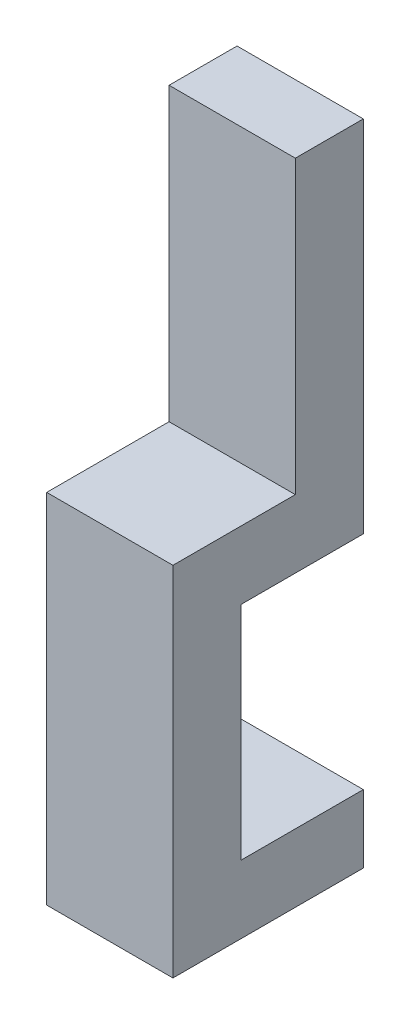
ISO-10303-21;
HEADER;
FILE_DESCRIPTION(('STEP AP214'),'2;1');
FILE_NAME('part.step','',(''),(''),'','','');
FILE_SCHEMA(('AUTOMOTIVE_DESIGN { 1 0 10303 214 1 1 1 1 }'));
ENDSEC;
DATA;
#1=APPLICATION_CONTEXT('core data for automotive mechanical design processes');
#2=APPLICATION_PROTOCOL_DEFINITION('international standard','automotive_design',2000,#1);
#3=PRODUCT_CONTEXT('',#1,'mechanical');
#4=PRODUCT('Part','Part','',(#3));
#5=PRODUCT_RELATED_PRODUCT_CATEGORY('part','',(#4));
#6=PRODUCT_DEFINITION_FORMATION('','',#4);
#7=PRODUCT_DEFINITION_CONTEXT('part definition',#1,'design');
#8=PRODUCT_DEFINITION('design','',#6,#7);
#9=PRODUCT_DEFINITION_SHAPE('','',#8);
#10=(LENGTH_UNIT() NAMED_UNIT(*) SI_UNIT(.MILLI.,.METRE.));
#11=(NAMED_UNIT(*) PLANE_ANGLE_UNIT() SI_UNIT($,.RADIAN.));
#12=(NAMED_UNIT(*) SI_UNIT($,.STERADIAN.) SOLID_ANGLE_UNIT());
#13=UNCERTAINTY_MEASURE_WITH_UNIT(LENGTH_MEASURE(1.E-05),#10,'distance_accuracy_value','');
#14=(GEOMETRIC_REPRESENTATION_CONTEXT(3) GLOBAL_UNCERTAINTY_ASSIGNED_CONTEXT((#13)) GLOBAL_UNIT_ASSIGNED_CONTEXT((#10,
#11,#12)) REPRESENTATION_CONTEXT('',''));
#15=CARTESIAN_POINT('',(0.,0.,0.));
#16=DIRECTION('',(0.,0.,1.));
#17=DIRECTION('',(1.,0.,0.));
#18=AXIS2_PLACEMENT_3D('',#15,#16,#17);
#19=CARTESIAN_POINT('',(13.,5.16143960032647,46.790151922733));
#20=DIRECTION('',(0.,0.,1.));
#21=DIRECTION('',(1.,0.,0.));
#22=AXIS2_PLACEMENT_3D('',#19,#20,#21);
#23=PLANE('',#22);
#24=DIRECTION('',(0.,1.,0.));
#25=VECTOR('',#24,1.);
#26=CARTESIAN_POINT('',(0.,5.16143960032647,46.790151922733));
#27=LINE('',#26,#25);
#28=CARTESIAN_POINT('',(0.,-17.6385603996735,46.790151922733));
#29=VERTEX_POINT('',#28);
#30=CARTESIAN_POINT('',(0.,5.16143960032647,46.790151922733));
#31=VERTEX_POINT('',#30);
#32=EDGE_CURVE('E140',#29,#31,#27,.T.);
#33=ORIENTED_EDGE('',*,*,#32,.T.);
#34=DIRECTION('',(-1.,0.,0.));
#35=VECTOR('',#34,1.);
#36=CARTESIAN_POINT('',(13.,5.16143960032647,46.790151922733));
#37=LINE('',#36,#35);
#38=CARTESIAN_POINT('',(13.,5.16143960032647,46.790151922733));
#39=VERTEX_POINT('',#38);
#40=EDGE_CURVE('E11',#39,#31,#37,.T.);
#41=ORIENTED_EDGE('',*,*,#40,.F.);
#42=DIRECTION('',(0.,1.,0.));
#43=VECTOR('',#42,1.);
#44=CARTESIAN_POINT('',(13.,5.16143960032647,46.790151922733));
#45=LINE('',#44,#43);
#46=CARTESIAN_POINT('',(13.,-17.6385603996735,46.790151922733));
#47=VERTEX_POINT('',#46);
#48=EDGE_CURVE('E161',#47,#39,#45,.T.);
#49=ORIENTED_EDGE('',*,*,#48,.F.);
#50=DIRECTION('',(-1.,0.,0.));
#51=VECTOR('',#50,1.);
#52=CARTESIAN_POINT('',(13.,-17.6385603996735,46.790151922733));
#53=LINE('',#52,#51);
#54=EDGE_CURVE('E136',#47,#29,#53,.T.);
#55=ORIENTED_EDGE('',*,*,#54,.T.);
#56=EDGE_LOOP('',(#33,#41,#49,#55));
#57=FACE_BOUND('',#56,.T.);
#58=ADVANCED_FACE('F33',(#57),#23,.F.);
#59=CARTESIAN_POINT('',(13.,5.16143960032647,46.790151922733));
#60=DIRECTION('',(0.,1.,0.));
#61=DIRECTION('',(0.,0.,1.));
#62=AXIS2_PLACEMENT_3D('',#59,#60,#61);
#63=PLANE('',#62);
#64=DIRECTION('',(0.,0.,-1.));
#65=VECTOR('',#64,1.);
#66=CARTESIAN_POINT('',(0.,5.16143960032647,46.790151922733));
#67=LINE('',#66,#65);
#68=CARTESIAN_POINT('',(0.,5.16143960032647,34.190151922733));
#69=VERTEX_POINT('',#68);
#70=EDGE_CURVE('E143',#31,#69,#67,.T.);
#71=ORIENTED_EDGE('',*,*,#70,.T.);
#72=DIRECTION('',(-1.,0.,0.));
#73=VECTOR('',#72,1.);
#74=CARTESIAN_POINT('',(13.,5.16143960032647,34.190151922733));
#75=LINE('',#74,#73);
#76=CARTESIAN_POINT('',(13.,5.16143960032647,34.190151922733));
#77=VERTEX_POINT('',#76);
#78=EDGE_CURVE('E41',#77,#69,#75,.T.);
#79=ORIENTED_EDGE('',*,*,#78,.F.);
#80=DIRECTION('',(0.,0.,-1.));
#81=VECTOR('',#80,1.);
#82=CARTESIAN_POINT('',(13.,5.16143960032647,46.790151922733));
#83=LINE('',#82,#81);
#84=EDGE_CURVE('E98',#39,#77,#83,.T.);
#85=ORIENTED_EDGE('',*,*,#84,.F.);
#86=ORIENTED_EDGE('',*,*,#40,.T.);
#87=EDGE_LOOP('',(#71,#79,#85,#86));
#88=FACE_BOUND('',#87,.T.);
#89=ADVANCED_FACE('F182',(#88),#63,.F.);
#90=CARTESIAN_POINT('',(13.,42.1614396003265,34.190151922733));
#91=DIRECTION('',(0.,0.,1.));
#92=DIRECTION('',(1.,0.,0.));
#93=AXIS2_PLACEMENT_3D('',#90,#91,#92);
#94=PLANE('',#93);
#95=DIRECTION('',(0.,1.,0.));
#96=VECTOR('',#95,1.);
#97=CARTESIAN_POINT('',(0.,42.1614396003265,34.190151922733));
#98=LINE('',#97,#96);
#99=CARTESIAN_POINT('',(0.,42.1614396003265,34.190151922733));
#100=VERTEX_POINT('',#99);
#101=EDGE_CURVE('E146',#69,#100,#98,.T.);
#102=ORIENTED_EDGE('',*,*,#101,.T.);
#103=DIRECTION('',(-1.,0.,0.));
#104=VECTOR('',#103,1.);
#105=CARTESIAN_POINT('',(13.,42.1614396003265,34.190151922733));
#106=LINE('',#105,#104);
#107=CARTESIAN_POINT('',(13.,42.1614396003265,34.190151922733));
#108=VERTEX_POINT('',#107);
#109=EDGE_CURVE('E174',#108,#100,#106,.T.);
#110=ORIENTED_EDGE('',*,*,#109,.F.);
#111=DIRECTION('',(0.,1.,0.));
#112=VECTOR('',#111,1.);
#113=CARTESIAN_POINT('',(13.,12.1614396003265,34.190151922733));
#114=LINE('',#113,#112);
#115=EDGE_CURVE('E181',#77,#108,#114,.T.);
#116=ORIENTED_EDGE('',*,*,#115,.F.);
#117=ORIENTED_EDGE('',*,*,#78,.T.);
#118=EDGE_LOOP('',(#102,#110,#116,#117));
#119=FACE_BOUND('',#118,.T.);
#120=ADVANCED_FACE('F179',(#119),#94,.F.);
#121=CARTESIAN_POINT('',(13.,42.1614396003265,41.1901519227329));
#122=DIRECTION('',(0.,-1.,0.));
#123=DIRECTION('',(0.,0.,-1.));
#124=AXIS2_PLACEMENT_3D('',#121,#122,#123);
#125=PLANE('',#124);
#126=DIRECTION('',(0.,0.,1.));
#127=VECTOR('',#126,1.);
#128=CARTESIAN_POINT('',(0.,42.1614396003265,41.1901519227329));
#129=LINE('',#128,#127);
#130=CARTESIAN_POINT('',(0.,42.1614396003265,41.1901519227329));
#131=VERTEX_POINT('',#130);
#132=EDGE_CURVE('E148',#100,#131,#129,.T.);
#133=ORIENTED_EDGE('',*,*,#132,.T.);
#134=DIRECTION('',(-1.,0.,0.));
#135=VECTOR('',#134,1.);
#136=CARTESIAN_POINT('',(13.,42.1614396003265,41.1901519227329));
#137=LINE('',#136,#135);
#138=CARTESIAN_POINT('',(13.,42.1614396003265,41.1901519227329));
#139=VERTEX_POINT('',#138);
#140=EDGE_CURVE('E171',#139,#131,#137,.T.);
#141=ORIENTED_EDGE('',*,*,#140,.F.);
#142=DIRECTION('',(0.,0.,1.));
#143=VECTOR('',#142,1.);
#144=CARTESIAN_POINT('',(13.,42.1614396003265,41.1901519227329));
#145=LINE('',#144,#143);
#146=EDGE_CURVE('E201',#108,#139,#145,.T.);
#147=ORIENTED_EDGE('',*,*,#146,.F.);
#148=ORIENTED_EDGE('',*,*,#109,.T.);
#149=EDGE_LOOP('',(#133,#141,#147,#148));
#150=FACE_BOUND('',#149,.T.);
#151=ADVANCED_FACE('F192',(#150),#125,.F.);
#152=CARTESIAN_POINT('',(13.,12.1614396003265,41.1901519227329));
#153=DIRECTION('',(0.,0.,-1.));
#154=DIRECTION('',(-1.,0.,0.));
#155=AXIS2_PLACEMENT_3D('',#152,#153,#154);
#156=PLANE('',#155);
#157=DIRECTION('',(0.,-1.,0.));
#158=VECTOR('',#157,1.);
#159=CARTESIAN_POINT('',(0.,12.1614396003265,41.1901519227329));
#160=LINE('',#159,#158);
#161=CARTESIAN_POINT('',(0.,12.1614396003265,41.1901519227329));
#162=VERTEX_POINT('',#161);
#163=EDGE_CURVE('E150',#131,#162,#160,.T.);
#164=ORIENTED_EDGE('',*,*,#163,.T.);
#165=DIRECTION('',(-1.,0.,0.));
#166=VECTOR('',#165,1.);
#167=CARTESIAN_POINT('',(13.,12.1614396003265,41.1901519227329));
#168=LINE('',#167,#166);
#169=CARTESIAN_POINT('',(13.,12.1614396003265,41.1901519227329));
#170=VERTEX_POINT('',#169);
#171=EDGE_CURVE('E168',#170,#162,#168,.T.);
#172=ORIENTED_EDGE('',*,*,#171,.F.);
#173=DIRECTION('',(0.,-1.,0.));
#174=VECTOR('',#173,1.);
#175=CARTESIAN_POINT('',(13.,12.1614396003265,41.1901519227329));
#176=LINE('',#175,#174);
#177=EDGE_CURVE('E198',#139,#170,#176,.T.);
#178=ORIENTED_EDGE('',*,*,#177,.F.);
#179=ORIENTED_EDGE('',*,*,#140,.T.);
#180=EDGE_LOOP('',(#164,#172,#178,#179));
#181=FACE_BOUND('',#180,.T.);
#182=ADVANCED_FACE('F196',(#181),#156,.F.);
#183=CARTESIAN_POINT('',(13.,12.1614396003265,41.1901519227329));
#184=DIRECTION('',(0.,-1.,0.));
#185=DIRECTION('',(0.,0.,-1.));
#186=AXIS2_PLACEMENT_3D('',#183,#184,#185);
#187=PLANE('',#186);
#188=DIRECTION('',(0.,0.,1.));
#189=VECTOR('',#188,1.);
#190=CARTESIAN_POINT('',(0.,12.1614396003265,41.1901519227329));
#191=LINE('',#190,#189);
#192=CARTESIAN_POINT('',(0.,12.1614396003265,53.790151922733));
#193=VERTEX_POINT('',#192);
#194=EDGE_CURVE('E152',#162,#193,#191,.T.);
#195=ORIENTED_EDGE('',*,*,#194,.T.);
#196=DIRECTION('',(-1.,0.,0.));
#197=VECTOR('',#196,1.);
#198=CARTESIAN_POINT('',(13.,12.1614396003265,53.790151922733));
#199=LINE('',#198,#197);
#200=CARTESIAN_POINT('',(13.,12.1614396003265,53.790151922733));
#201=VERTEX_POINT('',#200);
#202=EDGE_CURVE('E165',#201,#193,#199,.T.);
#203=ORIENTED_EDGE('',*,*,#202,.F.);
#204=DIRECTION('',(0.,0.,1.));
#205=VECTOR('',#204,1.);
#206=CARTESIAN_POINT('',(13.,12.1614396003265,41.1901519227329));
#207=LINE('',#206,#205);
#208=EDGE_CURVE('E200',#170,#201,#207,.T.);
#209=ORIENTED_EDGE('',*,*,#208,.F.);
#210=ORIENTED_EDGE('',*,*,#171,.T.);
#211=EDGE_LOOP('',(#195,#203,#209,#210));
#212=FACE_BOUND('',#211,.T.);
#213=ADVANCED_FACE('F215',(#212),#187,.F.);
#214=CARTESIAN_POINT('',(13.,-12.6385603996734,53.790151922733));
#215=DIRECTION('',(0.,0.,-1.));
#216=DIRECTION('',(0.,1.,0.));
#217=AXIS2_PLACEMENT_3D('',#214,#215,#216);
#218=PLANE('',#217);
#219=DIRECTION('',(0.,-1.,0.));
#220=VECTOR('',#219,1.);
#221=CARTESIAN_POINT('',(0.,-12.6385603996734,53.790151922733));
#222=LINE('',#221,#220);
#223=CARTESIAN_POINT('',(0.,-24.6385603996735,53.790151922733));
#224=VERTEX_POINT('',#223);
#225=EDGE_CURVE('E155',#193,#224,#222,.T.);
#226=ORIENTED_EDGE('',*,*,#225,.T.);
#227=DIRECTION('',(-1.,0.,0.));
#228=VECTOR('',#227,1.);
#229=CARTESIAN_POINT('',(13.,-24.6385603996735,53.790151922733));
#230=LINE('',#229,#228);
#231=CARTESIAN_POINT('',(13.,-24.6385603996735,53.790151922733));
#232=VERTEX_POINT('',#231);
#233=EDGE_CURVE('E131',#232,#224,#230,.T.);
#234=ORIENTED_EDGE('',*,*,#233,.F.);
#235=DIRECTION('',(0.,-1.,0.));
#236=VECTOR('',#235,1.);
#237=CARTESIAN_POINT('',(13.,0.161439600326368,53.790151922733));
#238=LINE('',#237,#236);
#239=EDGE_CURVE('E123',#201,#232,#238,.T.);
#240=ORIENTED_EDGE('',*,*,#239,.F.);
#241=ORIENTED_EDGE('',*,*,#202,.T.);
#242=EDGE_LOOP('',(#226,#234,#240,#241));
#243=FACE_BOUND('',#242,.T.);
#244=ADVANCED_FACE('F212',(#243),#218,.F.);
#245=CARTESIAN_POINT('',(13.,-24.6385603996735,41.7901519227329));
#246=DIRECTION('',(0.,1.,0.));
#247=DIRECTION('',(0.,0.,1.));
#248=AXIS2_PLACEMENT_3D('',#245,#246,#247);
#249=PLANE('',#248);
#250=DIRECTION('',(0.,0.,-1.));
#251=VECTOR('',#250,1.);
#252=CARTESIAN_POINT('',(0.,-24.6385603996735,41.7901519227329));
#253=LINE('',#252,#251);
#254=CARTESIAN_POINT('',(0.,-24.6385603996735,34.190151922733));
#255=VERTEX_POINT('',#254);
#256=EDGE_CURVE('E130',#224,#255,#253,.T.);
#257=ORIENTED_EDGE('',*,*,#256,.T.);
#258=DIRECTION('',(-1.,0.,0.));
#259=VECTOR('',#258,1.);
#260=CARTESIAN_POINT('',(13.,-24.6385603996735,34.190151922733));
#261=LINE('',#260,#259);
#262=CARTESIAN_POINT('',(13.,-24.6385603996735,34.190151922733));
#263=VERTEX_POINT('',#262);
#264=EDGE_CURVE('E128',#263,#255,#261,.T.);
#265=ORIENTED_EDGE('',*,*,#264,.F.);
#266=DIRECTION('',(0.,0.,-1.));
#267=VECTOR('',#266,1.);
#268=CARTESIAN_POINT('',(13.,-24.6385603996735,41.7901519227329));
#269=LINE('',#268,#267);
#270=EDGE_CURVE('E117',#232,#263,#269,.T.);
#271=ORIENTED_EDGE('',*,*,#270,.F.);
#272=ORIENTED_EDGE('',*,*,#233,.T.);
#273=EDGE_LOOP('',(#257,#265,#271,#272));
#274=FACE_BOUND('',#273,.T.);
#275=ADVANCED_FACE('F129',(#274),#249,.F.);
#276=CARTESIAN_POINT('',(13.,-17.6385603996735,34.190151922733));
#277=DIRECTION('',(0.,0.,1.));
#278=DIRECTION('',(1.,0.,0.));
#279=AXIS2_PLACEMENT_3D('',#276,#277,#278);
#280=PLANE('',#279);
#281=DIRECTION('',(0.,1.,0.));
#282=VECTOR('',#281,1.);
#283=CARTESIAN_POINT('',(0.,-17.6385603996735,34.190151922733));
#284=LINE('',#283,#282);
#285=CARTESIAN_POINT('',(0.,-17.6385603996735,34.190151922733));
#286=VERTEX_POINT('',#285);
#287=EDGE_CURVE('E84',#255,#286,#284,.T.);
#288=ORIENTED_EDGE('',*,*,#287,.T.);
#289=DIRECTION('',(-1.,0.,0.));
#290=VECTOR('',#289,1.);
#291=CARTESIAN_POINT('',(13.,-17.6385603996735,34.190151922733));
#292=LINE('',#291,#290);
#293=CARTESIAN_POINT('',(13.,-17.6385603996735,34.190151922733));
#294=VERTEX_POINT('',#293);
#295=EDGE_CURVE('E132',#294,#286,#292,.T.);
#296=ORIENTED_EDGE('',*,*,#295,.F.);
#297=DIRECTION('',(0.,1.,0.));
#298=VECTOR('',#297,1.);
#299=CARTESIAN_POINT('',(13.,-17.6385603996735,34.190151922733));
#300=LINE('',#299,#298);
#301=EDGE_CURVE('E121',#263,#294,#300,.T.);
#302=ORIENTED_EDGE('',*,*,#301,.F.);
#303=ORIENTED_EDGE('',*,*,#264,.T.);
#304=EDGE_LOOP('',(#288,#296,#302,#303));
#305=FACE_BOUND('',#304,.T.);
#306=ADVANCED_FACE('F134',(#305),#280,.F.);
#307=CARTESIAN_POINT('',(13.,-17.6385603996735,46.790151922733));
#308=DIRECTION('',(0.,-1.,0.));
#309=DIRECTION('',(0.,0.,-1.));
#310=AXIS2_PLACEMENT_3D('',#307,#308,#309);
#311=PLANE('',#310);
#312=DIRECTION('',(0.,0.,1.));
#313=VECTOR('',#312,1.);
#314=CARTESIAN_POINT('',(0.,-17.6385603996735,46.790151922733));
#315=LINE('',#314,#313);
#316=EDGE_CURVE('E90',#286,#29,#315,.T.);
#317=ORIENTED_EDGE('',*,*,#316,.T.);
#318=ORIENTED_EDGE('',*,*,#54,.F.);
#319=DIRECTION('',(0.,0.,1.));
#320=VECTOR('',#319,1.);
#321=CARTESIAN_POINT('',(13.,-17.6385603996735,46.790151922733));
#322=LINE('',#321,#320);
#323=EDGE_CURVE('E49',#294,#47,#322,.T.);
#324=ORIENTED_EDGE('',*,*,#323,.F.);
#325=ORIENTED_EDGE('',*,*,#295,.T.);
#326=EDGE_LOOP('',(#317,#318,#324,#325));
#327=FACE_BOUND('',#326,.T.);
#328=ADVANCED_FACE('F210',(#327),#311,.F.);
#329=CARTESIAN_POINT('',(13.,0.,0.));
#330=DIRECTION('',(1.,0.,0.));
#331=DIRECTION('',(0.,0.,-1.));
#332=AXIS2_PLACEMENT_3D('',#329,#330,#331);
#333=PLANE('',#332);
#334=ORIENTED_EDGE('',*,*,#48,.T.);
#335=ORIENTED_EDGE('',*,*,#84,.T.);
#336=ORIENTED_EDGE('',*,*,#115,.T.);
#337=ORIENTED_EDGE('',*,*,#146,.T.);
#338=ORIENTED_EDGE('',*,*,#177,.T.);
#339=ORIENTED_EDGE('',*,*,#208,.T.);
#340=ORIENTED_EDGE('',*,*,#239,.T.);
#341=ORIENTED_EDGE('',*,*,#270,.T.);
#342=ORIENTED_EDGE('',*,*,#301,.T.);
#343=ORIENTED_EDGE('',*,*,#323,.T.);
#344=EDGE_LOOP('',(#334,#335,#336,#337,#338,#339,#340,#341,#342,#343));
#345=FACE_BOUND('',#344,.T.);
#346=ADVANCED_FACE('F119',(#345),#333,.T.);
#347=CARTESIAN_POINT('',(0.,0.,0.));
#348=DIRECTION('',(1.,0.,0.));
#349=DIRECTION('',(0.,0.,-1.));
#350=AXIS2_PLACEMENT_3D('',#347,#348,#349);
#351=PLANE('',#350);
#352=ORIENTED_EDGE('',*,*,#32,.F.);
#353=ORIENTED_EDGE('',*,*,#316,.F.);
#354=ORIENTED_EDGE('',*,*,#287,.F.);
#355=ORIENTED_EDGE('',*,*,#256,.F.);
#356=ORIENTED_EDGE('',*,*,#225,.F.);
#357=ORIENTED_EDGE('',*,*,#194,.F.);
#358=ORIENTED_EDGE('',*,*,#163,.F.);
#359=ORIENTED_EDGE('',*,*,#132,.F.);
#360=ORIENTED_EDGE('',*,*,#101,.F.);
#361=ORIENTED_EDGE('',*,*,#70,.F.);
#362=EDGE_LOOP('',(#352,#353,#354,#355,#356,#357,#358,#359,#360,#361));
#363=FACE_BOUND('',#362,.T.);
#364=ADVANCED_FACE('F186',(#363),#351,.F.);
#365=CLOSED_SHELL('',(#58,#89,#120,#151,#182,#213,#244,#275,#306,#328,#346,#364));
#366=MANIFOLD_SOLID_BREP('B2',#365);
#367=ADVANCED_BREP_SHAPE_REPRESENTATION('',(#18,#366),#14);
#368=SHAPE_DEFINITION_REPRESENTATION(#9,#367);
ENDSEC;
END-ISO-10303-21;
